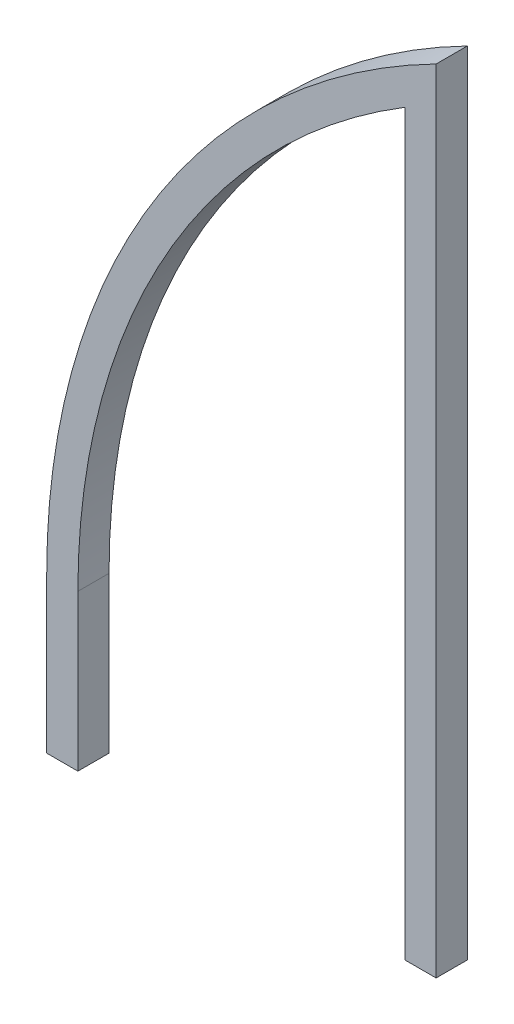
from build123d import *

# Parameters (mm, degrees)
SALIENTE_EXTRUIR1_DEPTH = 80


with BuildPart() as part:
    # Croquis1 → Saliente-Extruir1 (new body)
    with BuildSketch(Plane.XY):
        with BuildLine():
            Line((-481.701404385, -491.370616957), (-481.701404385, 1541.440775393))
            ThreePointArc((-481.701404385, 1541.440775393), (-1211.836219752, 865.978985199), (-1481.701404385, -91.370616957))
            Line((-1481.701404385, -91.370616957), (-1481.701404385, -491.370616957))
            Line((-1481.701404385, -491.370616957), (-1401.701404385, -491.370616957))
            Line((-1401.701404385, -491.370616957), (-1401.701404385, -91.370616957))
            ThreePointArc((-1401.701404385, -91.370616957), (-1177.344609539, 766.694263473), (-561.701404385, 1405.125743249))
            Line((-561.701404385, 1405.125743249), (-561.701404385, -491.370616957))
            Line((-561.701404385, -491.370616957), (-481.701404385, -491.370616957))
        make_face()
    extrude(amount=SALIENTE_EXTRUIR1_DEPTH)


solid = part.part
